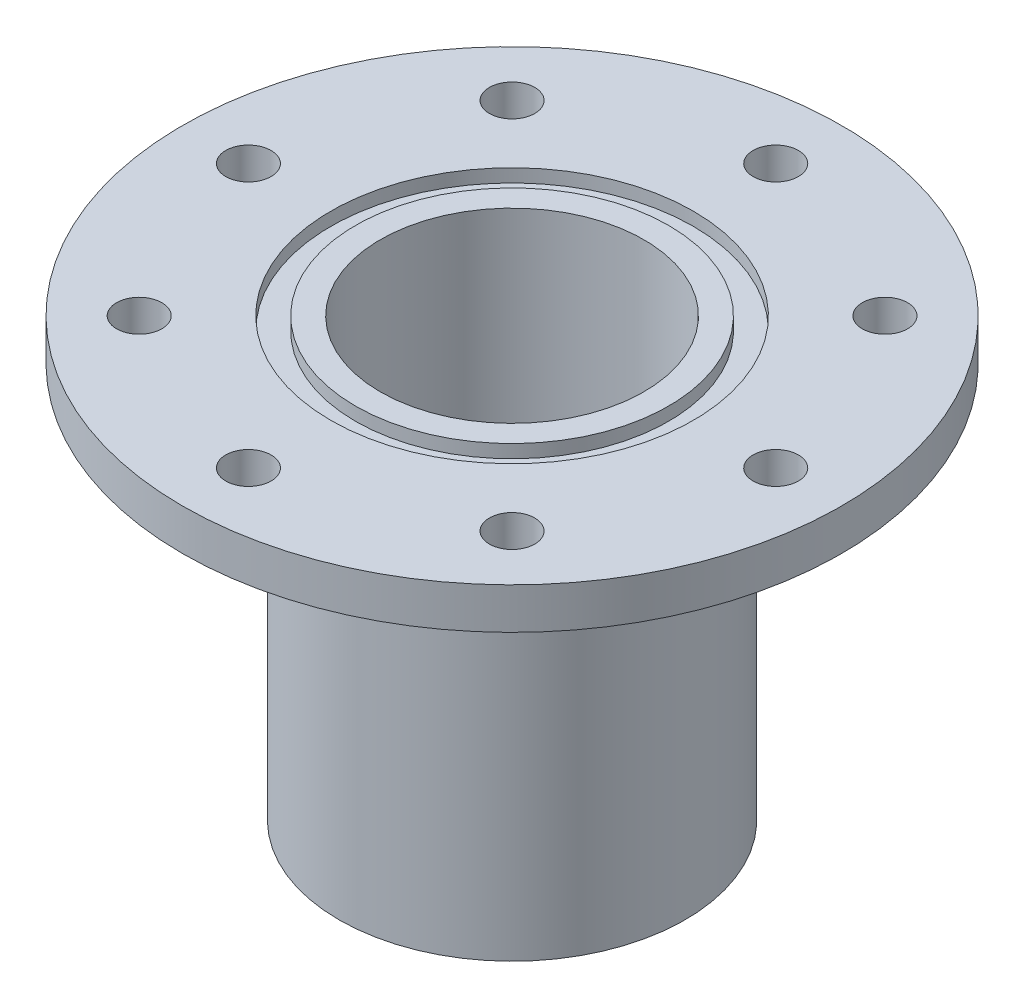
from build123d import *

# Parameters (mm, degrees)
FILLET1_R                       = 10.16
F_11_16_0_6875_DIAMETER_HOLE1_D = 17.4625
CIRPATTERN1_COUNT               = 8


with BuildPart() as part:
    # Sketch1 → Revolve1 (revolve)
    with BuildSketch(Plane.XY, mode=Mode.PRIVATE) as revolve1_sk:
        Polygon((50.8, -152.4), (66.675, -152.4), (66.675, 0), (127, 0), (127, 15.875), (69.85, 15.875), (69.85, 10.795), (60.325, 10.795), (60.325, 15.875), (50.8, 15.875), align=None)
    revolve(revolve1_sk.sketch.rotate(Axis((0, 66.332099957, 0), (0, -1, 0)), 90), axis=Axis((0, 66.332099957, 0), (0, -1, 0)))

    # Fillet1
    fillet1_edges = [part.edges().sort_by_distance(p)[0] for p in [
        (0, 0, -66.675),
    ]]
    fillet(fillet1_edges, radius=FILLET1_R)

    # 11_16 _0.6875_ Diameter Hole1 (through all)
    with Locations(Plane(origin=(0, 15.875, 0), x_dir=(-1, 0, 0), z_dir=(0, 1, 0))):
        with Locations((0, -101.6)):
            f_11_16_0_6875_diameter_hole1 = Hole(F_11_16_0_6875_DIAMETER_HOLE1_D / 2)

    # CirPattern1: 11_16 _0.6875_ Diameter Hole1 ×8 about axis
    cirpattern1_axis = Axis((0, 0, 0), (0, 1, 0))
    for i in range(1, CIRPATTERN1_COUNT):
        add(f_11_16_0_6875_diameter_hole1.rotate(cirpattern1_axis, i * 360 / CIRPATTERN1_COUNT), mode=Mode.SUBTRACT)


solid = part.part
